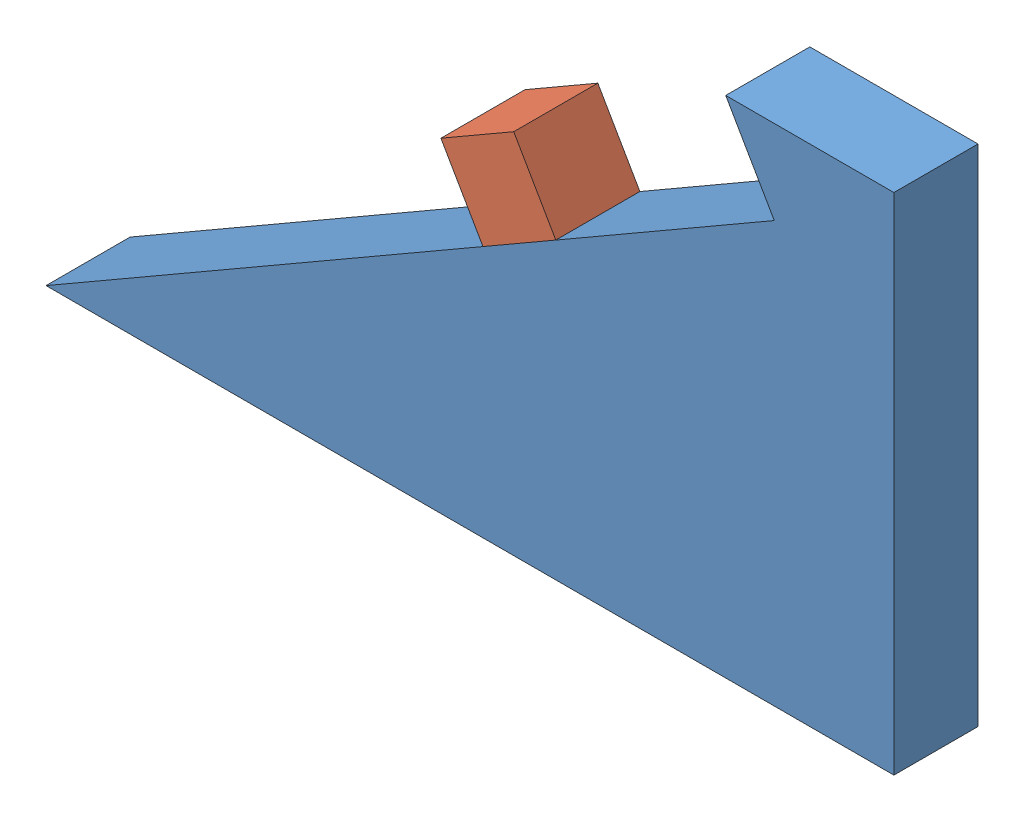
SolidWorks assembly Lesson3.SLDASM, configuration Default (file format 3400). Lengths in mm.
Overall size (256.11 152.4 25.4).
2 component instances, 2 part files, 3 mates.
Components (placement in the parent):
- ground-1: ground.SLDPRT [Default] at origin size (256.11 152.4 25.4)
- block-1: block.SLDPRT [Default] at (-83.3397 -33.4515 0) x (0.866025 0.5 0) z (0 0 1) size (25.4 25.4 25.4)
Mates (geometry in assembly coordinates):
- Coincident1: coincident anti-aligned: plane of ground-1 through (0 0 -12.7) normal (-0.5 0.866025 0); plane of block-1 through (-65.9911 -38.1 12.7) normal (0.5 -0.866025 0)
- Coincident3: coincident aligned: plane of ground-1 through (0 0 12.7) normal (0 0 1); plane of block-1 through (-100.6882 -28.803 12.7) normal (0 0 1)
- LimitDistance1: limit distance = 76.2 mm anti-aligned: plane of ground-1 through (0 0 -12.7) normal (-0.866025 -0.5 0); plane of block-1 through (-78.6911 -16.103 12.7) normal (0.866025 0.5 0)
